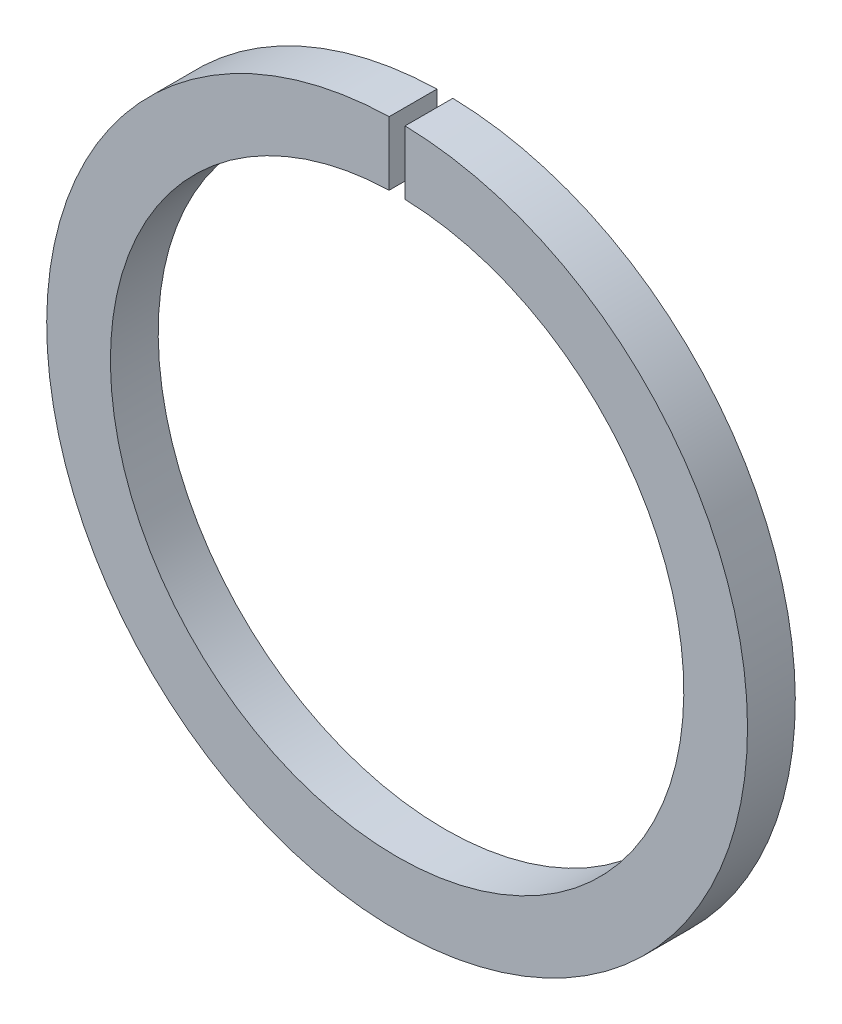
from build123d import *

# Parameters (mm, degrees)
EXTRUSION1_DEPTH = 1.5


with BuildPart() as part:
    # Esquisse1 → Extrusion1 (new body)
    with BuildSketch(Plane.XY):
        with BuildLine():
            Line((-0.25, 8.996527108), (-0.25, 10.997158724))
            ThreePointArc((-0.25, 10.997158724), (0, -11), (0.25, 10.997158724))
            Line((0.25, 10.997158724), (0.25, 8.996527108))
            ThreePointArc((0.25, 8.996527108), (0, -9), (-0.25, 8.996527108))
        make_face()
    extrude(amount=EXTRUSION1_DEPTH)


solid = part.part
